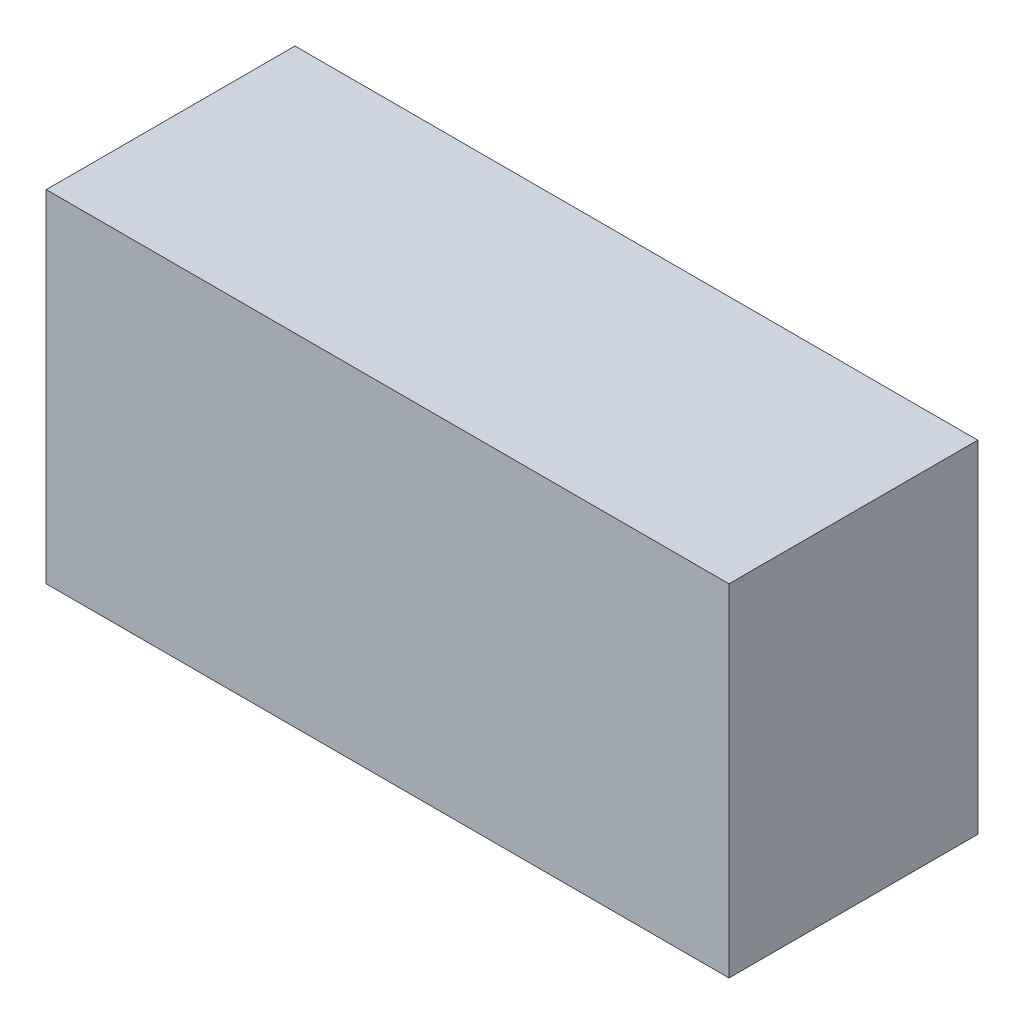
from build123d import *

# Parameters (mm, degrees)
SKETCH1_W           = 6096
SKETCH1_H           = 3048
BOSS_EXTRUDE1_DEPTH = 2220.976
SHELL1_T            = -304.8


with BuildPart() as part:
    # Sketch1 → Boss-Extrude1 (new body)
    with BuildSketch(Plane.XY):
        with Locations((3048, 1524)):
            Rectangle(SKETCH1_W, SKETCH1_H)
    extrude(amount=BOSS_EXTRUDE1_DEPTH)

    # Shell1
    shell1_openings = [part.faces().sort_by_distance(p)[0] for p in [
        (3048, 1524, 0),
        (3048, 0, 1110.488),
        (0, 1524, 1110.488),
    ]]
    offset(amount=SHELL1_T, openings=shell1_openings, kind=Kind.INTERSECTION)


solid = part.part
